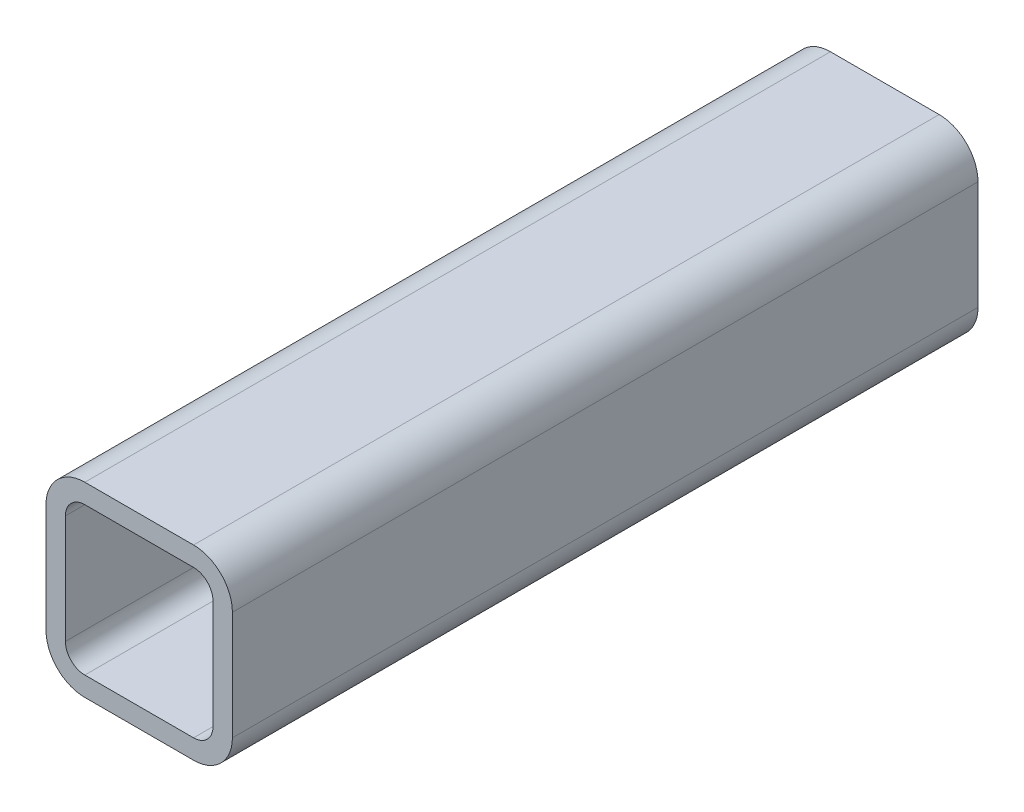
ISO-10303-21;
HEADER;
FILE_DESCRIPTION(('STEP AP214'),'2;1');
FILE_NAME('part.step','',(''),(''),'','','');
FILE_SCHEMA(('AUTOMOTIVE_DESIGN { 1 0 10303 214 1 1 1 1 }'));
ENDSEC;
DATA;
#1=APPLICATION_CONTEXT('core data for automotive mechanical design processes');
#2=APPLICATION_PROTOCOL_DEFINITION('international standard','automotive_design',2000,#1);
#3=PRODUCT_CONTEXT('',#1,'mechanical');
#4=PRODUCT('Part','Part','',(#3));
#5=PRODUCT_RELATED_PRODUCT_CATEGORY('part','',(#4));
#6=PRODUCT_DEFINITION_FORMATION('','',#4);
#7=PRODUCT_DEFINITION_CONTEXT('part definition',#1,'design');
#8=PRODUCT_DEFINITION('design','',#6,#7);
#9=PRODUCT_DEFINITION_SHAPE('','',#8);
#10=(LENGTH_UNIT() NAMED_UNIT(*) SI_UNIT(.MILLI.,.METRE.));
#11=(NAMED_UNIT(*) PLANE_ANGLE_UNIT() SI_UNIT($,.RADIAN.));
#12=(NAMED_UNIT(*) SI_UNIT($,.STERADIAN.) SOLID_ANGLE_UNIT());
#13=UNCERTAINTY_MEASURE_WITH_UNIT(LENGTH_MEASURE(1.E-05),#10,'distance_accuracy_value','');
#14=(GEOMETRIC_REPRESENTATION_CONTEXT(3) GLOBAL_UNCERTAINTY_ASSIGNED_CONTEXT((#13)) GLOBAL_UNIT_ASSIGNED_CONTEXT((#10,
#11,#12)) REPRESENTATION_CONTEXT('',''));
#15=CARTESIAN_POINT('',(0.,0.,0.));
#16=DIRECTION('',(0.,0.,1.));
#17=DIRECTION('',(1.,0.,0.));
#18=AXIS2_PLACEMENT_3D('',#15,#16,#17);
#19=CARTESIAN_POINT('',(18.3641160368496,62.4056737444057,304.8));
#20=DIRECTION('',(0.,0.,1.));
#21=DIRECTION('',(1.,0.,0.));
#22=AXIS2_PLACEMENT_3D('',#19,#20,#21);
#23=PLANE('',#22);
#24=CARTESIAN_POINT('',(18.3641160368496,62.4056737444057,304.8));
#25=DIRECTION('',(0.,0.,1.));
#26=DIRECTION('',(1.,0.,0.));
#27=AXIS2_PLACEMENT_3D('',#24,#25,#26);
#28=CIRCLE('',#27,15.875);
#29=CARTESIAN_POINT('',(18.3641160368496,78.2806737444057,304.8));
#30=VERTEX_POINT('',#29);
#31=CARTESIAN_POINT('',(2.48911603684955,62.4056737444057,304.8));
#32=VERTEX_POINT('',#31);
#33=EDGE_CURVE('E211',#30,#32,#28,.T.);
#34=ORIENTED_EDGE('',*,*,#33,.T.);
#35=DIRECTION('',(0.,-1.,0.));
#36=VECTOR('',#35,1.);
#37=CARTESIAN_POINT('',(2.48911603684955,17.9556737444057,304.8));
#38=LINE('',#37,#36);
#39=CARTESIAN_POINT('',(2.48911603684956,17.9556737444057,304.8));
#40=VERTEX_POINT('',#39);
#41=EDGE_CURVE('E214',#32,#40,#38,.T.);
#42=ORIENTED_EDGE('',*,*,#41,.T.);
#43=CARTESIAN_POINT('',(18.3641160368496,17.9556737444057,304.8));
#44=DIRECTION('',(0.,0.,1.));
#45=DIRECTION('',(1.,0.,0.));
#46=AXIS2_PLACEMENT_3D('',#43,#44,#45);
#47=CIRCLE('',#46,15.875);
#48=CARTESIAN_POINT('',(18.3641160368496,2.0806737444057,304.8));
#49=VERTEX_POINT('',#48);
#50=EDGE_CURVE('E217',#40,#49,#47,.T.);
#51=ORIENTED_EDGE('',*,*,#50,.T.);
#52=DIRECTION('',(1.,0.,0.));
#53=VECTOR('',#52,1.);
#54=CARTESIAN_POINT('',(62.8141160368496,2.0806737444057,304.8));
#55=LINE('',#54,#53);
#56=CARTESIAN_POINT('',(62.8141160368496,2.0806737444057,304.8));
#57=VERTEX_POINT('',#56);
#58=EDGE_CURVE('E219',#49,#57,#55,.T.);
#59=ORIENTED_EDGE('',*,*,#58,.T.);
#60=CARTESIAN_POINT('',(62.8141160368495,17.9556737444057,304.8));
#61=DIRECTION('',(0.,0.,1.));
#62=DIRECTION('',(1.,0.,0.));
#63=AXIS2_PLACEMENT_3D('',#60,#61,#62);
#64=CIRCLE('',#63,15.875);
#65=CARTESIAN_POINT('',(78.6891160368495,17.9556737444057,304.8));
#66=VERTEX_POINT('',#65);
#67=EDGE_CURVE('E221',#57,#66,#64,.T.);
#68=ORIENTED_EDGE('',*,*,#67,.T.);
#69=DIRECTION('',(0.,1.,0.));
#70=VECTOR('',#69,1.);
#71=CARTESIAN_POINT('',(78.6891160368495,62.4056737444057,304.8));
#72=LINE('',#71,#70);
#73=CARTESIAN_POINT('',(78.6891160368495,62.4056737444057,304.8));
#74=VERTEX_POINT('',#73);
#75=EDGE_CURVE('E223',#66,#74,#72,.T.);
#76=ORIENTED_EDGE('',*,*,#75,.T.);
#77=CARTESIAN_POINT('',(62.8141160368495,62.4056737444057,304.8));
#78=DIRECTION('',(0.,0.,1.));
#79=DIRECTION('',(1.,0.,0.));
#80=AXIS2_PLACEMENT_3D('',#77,#78,#79);
#81=CIRCLE('',#80,15.875);
#82=CARTESIAN_POINT('',(62.8141160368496,78.2806737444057,304.8));
#83=VERTEX_POINT('',#82);
#84=EDGE_CURVE('E225',#74,#83,#81,.T.);
#85=ORIENTED_EDGE('',*,*,#84,.T.);
#86=DIRECTION('',(-1.,0.,0.));
#87=VECTOR('',#86,1.);
#88=CARTESIAN_POINT('',(18.3641160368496,78.2806737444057,304.8));
#89=LINE('',#88,#87);
#90=EDGE_CURVE('E227',#83,#30,#89,.T.);
#91=ORIENTED_EDGE('',*,*,#90,.T.);
#92=EDGE_LOOP('',(#34,#42,#51,#59,#68,#76,#85,#91));
#93=FACE_BOUND('',#92,.T.);
#94=DIRECTION('',(0.,-1.,0.));
#95=VECTOR('',#94,1.);
#96=CARTESIAN_POINT('',(10.4266160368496,17.9556737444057,304.8));
#97=LINE('',#96,#95);
#98=CARTESIAN_POINT('',(10.4266160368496,62.4056737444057,304.8));
#99=VERTEX_POINT('',#98);
#100=CARTESIAN_POINT('',(10.4266160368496,17.9556737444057,304.8));
#101=VERTEX_POINT('',#100);
#102=EDGE_CURVE('E154',#99,#101,#97,.T.);
#103=ORIENTED_EDGE('',*,*,#102,.F.);
#104=CARTESIAN_POINT('',(18.3641160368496,62.4056737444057,304.8));
#105=DIRECTION('',(0.,0.,1.));
#106=DIRECTION('',(1.,0.,0.));
#107=AXIS2_PLACEMENT_3D('',#104,#105,#106);
#108=CIRCLE('',#107,7.9375);
#109=CARTESIAN_POINT('',(18.3641160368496,70.3431737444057,304.8));
#110=VERTEX_POINT('',#109);
#111=EDGE_CURVE('E146',#110,#99,#108,.T.);
#112=ORIENTED_EDGE('',*,*,#111,.F.);
#113=DIRECTION('',(-1.,0.,0.));
#114=VECTOR('',#113,1.);
#115=CARTESIAN_POINT('',(18.3641160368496,70.3431737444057,304.8));
#116=LINE('',#115,#114);
#117=CARTESIAN_POINT('',(62.8141160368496,70.3431737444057,304.8));
#118=VERTEX_POINT('',#117);
#119=EDGE_CURVE('E179',#118,#110,#116,.T.);
#120=ORIENTED_EDGE('',*,*,#119,.F.);
#121=CARTESIAN_POINT('',(62.8141160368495,62.4056737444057,304.8));
#122=DIRECTION('',(0.,0.,1.));
#123=DIRECTION('',(1.,0.,0.));
#124=AXIS2_PLACEMENT_3D('',#121,#122,#123);
#125=CIRCLE('',#124,7.9375);
#126=CARTESIAN_POINT('',(70.7516160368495,62.4056737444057,304.8));
#127=VERTEX_POINT('',#126);
#128=EDGE_CURVE('E177',#127,#118,#125,.T.);
#129=ORIENTED_EDGE('',*,*,#128,.F.);
#130=DIRECTION('',(0.,1.,0.));
#131=VECTOR('',#130,1.);
#132=CARTESIAN_POINT('',(70.7516160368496,62.4056737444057,304.8));
#133=LINE('',#132,#131);
#134=CARTESIAN_POINT('',(70.7516160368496,17.9556737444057,304.8));
#135=VERTEX_POINT('',#134);
#136=EDGE_CURVE('E175',#135,#127,#133,.T.);
#137=ORIENTED_EDGE('',*,*,#136,.F.);
#138=CARTESIAN_POINT('',(62.8141160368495,17.9556737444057,304.8));
#139=DIRECTION('',(0.,0.,1.));
#140=DIRECTION('',(1.,0.,0.));
#141=AXIS2_PLACEMENT_3D('',#138,#139,#140);
#142=CIRCLE('',#141,7.93750000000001);
#143=CARTESIAN_POINT('',(62.8141160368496,10.0181737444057,304.8));
#144=VERTEX_POINT('',#143);
#145=EDGE_CURVE('E173',#144,#135,#142,.T.);
#146=ORIENTED_EDGE('',*,*,#145,.F.);
#147=DIRECTION('',(1.,0.,0.));
#148=VECTOR('',#147,1.);
#149=CARTESIAN_POINT('',(62.8141160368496,10.0181737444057,304.8));
#150=LINE('',#149,#148);
#151=CARTESIAN_POINT('',(18.3641160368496,10.0181737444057,304.8));
#152=VERTEX_POINT('',#151);
#153=EDGE_CURVE('E169',#152,#144,#150,.T.);
#154=ORIENTED_EDGE('',*,*,#153,.F.);
#155=CARTESIAN_POINT('',(18.3641160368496,17.9556737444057,304.8));
#156=DIRECTION('',(0.,0.,1.));
#157=DIRECTION('',(1.,0.,0.));
#158=AXIS2_PLACEMENT_3D('',#155,#156,#157);
#159=CIRCLE('',#158,7.9375);
#160=EDGE_CURVE('E167',#101,#152,#159,.T.);
#161=ORIENTED_EDGE('',*,*,#160,.F.);
#162=EDGE_LOOP('',(#103,#112,#120,#129,#137,#146,#154,#161));
#163=FACE_BOUND('',#162,.T.);
#164=ADVANCED_FACE('F33',(#93,#163),#23,.T.);
#165=CARTESIAN_POINT('',(18.3641160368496,62.4056737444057,0.));
#166=DIRECTION('',(0.,0.,1.));
#167=DIRECTION('',(1.,0.,0.));
#168=AXIS2_PLACEMENT_3D('',#165,#166,#167);
#169=PLANE('',#168);
#170=CARTESIAN_POINT('',(18.3641160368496,62.4056737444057,0.));
#171=DIRECTION('',(0.,0.,1.));
#172=DIRECTION('',(1.,0.,0.));
#173=AXIS2_PLACEMENT_3D('',#170,#171,#172);
#174=CIRCLE('',#173,15.875);
#175=CARTESIAN_POINT('',(18.3641160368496,78.2806737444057,0.));
#176=VERTEX_POINT('',#175);
#177=CARTESIAN_POINT('',(2.48911603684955,62.4056737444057,0.));
#178=VERTEX_POINT('',#177);
#179=EDGE_CURVE('E162',#176,#178,#174,.T.);
#180=ORIENTED_EDGE('',*,*,#179,.F.);
#181=DIRECTION('',(-1.,0.,0.));
#182=VECTOR('',#181,1.);
#183=CARTESIAN_POINT('',(18.3641160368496,78.2806737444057,0.));
#184=LINE('',#183,#182);
#185=CARTESIAN_POINT('',(62.8141160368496,78.2806737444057,0.));
#186=VERTEX_POINT('',#185);
#187=EDGE_CURVE('E215',#186,#176,#184,.T.);
#188=ORIENTED_EDGE('',*,*,#187,.F.);
#189=CARTESIAN_POINT('',(62.8141160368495,62.4056737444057,0.));
#190=DIRECTION('',(0.,0.,1.));
#191=DIRECTION('',(1.,0.,0.));
#192=AXIS2_PLACEMENT_3D('',#189,#190,#191);
#193=CIRCLE('',#192,15.875);
#194=CARTESIAN_POINT('',(78.6891160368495,62.4056737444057,0.));
#195=VERTEX_POINT('',#194);
#196=EDGE_CURVE('E242',#195,#186,#193,.T.);
#197=ORIENTED_EDGE('',*,*,#196,.F.);
#198=DIRECTION('',(0.,1.,0.));
#199=VECTOR('',#198,1.);
#200=CARTESIAN_POINT('',(78.6891160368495,62.4056737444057,0.));
#201=LINE('',#200,#199);
#202=CARTESIAN_POINT('',(78.6891160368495,17.9556737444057,0.));
#203=VERTEX_POINT('',#202);
#204=EDGE_CURVE('E240',#203,#195,#201,.T.);
#205=ORIENTED_EDGE('',*,*,#204,.F.);
#206=CARTESIAN_POINT('',(62.8141160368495,17.9556737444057,0.));
#207=DIRECTION('',(0.,0.,1.));
#208=DIRECTION('',(1.,0.,0.));
#209=AXIS2_PLACEMENT_3D('',#206,#207,#208);
#210=CIRCLE('',#209,15.875);
#211=CARTESIAN_POINT('',(62.8141160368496,2.0806737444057,0.));
#212=VERTEX_POINT('',#211);
#213=EDGE_CURVE('E238',#212,#203,#210,.T.);
#214=ORIENTED_EDGE('',*,*,#213,.F.);
#215=DIRECTION('',(1.,0.,0.));
#216=VECTOR('',#215,1.);
#217=CARTESIAN_POINT('',(62.8141160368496,2.0806737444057,0.));
#218=LINE('',#217,#216);
#219=CARTESIAN_POINT('',(18.3641160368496,2.0806737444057,0.));
#220=VERTEX_POINT('',#219);
#221=EDGE_CURVE('E236',#220,#212,#218,.T.);
#222=ORIENTED_EDGE('',*,*,#221,.F.);
#223=CARTESIAN_POINT('',(18.3641160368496,17.9556737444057,0.));
#224=DIRECTION('',(0.,0.,1.));
#225=DIRECTION('',(1.,0.,0.));
#226=AXIS2_PLACEMENT_3D('',#223,#224,#225);
#227=CIRCLE('',#226,15.875);
#228=CARTESIAN_POINT('',(2.48911603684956,17.9556737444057,0.));
#229=VERTEX_POINT('',#228);
#230=EDGE_CURVE('E234',#229,#220,#227,.T.);
#231=ORIENTED_EDGE('',*,*,#230,.F.);
#232=DIRECTION('',(0.,-1.,0.));
#233=VECTOR('',#232,1.);
#234=CARTESIAN_POINT('',(2.48911603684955,17.9556737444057,0.));
#235=LINE('',#234,#233);
#236=EDGE_CURVE('E232',#178,#229,#235,.T.);
#237=ORIENTED_EDGE('',*,*,#236,.F.);
#238=EDGE_LOOP('',(#180,#188,#197,#205,#214,#222,#231,#237));
#239=FACE_BOUND('',#238,.T.);
#240=CARTESIAN_POINT('',(18.3641160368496,62.4056737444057,0.));
#241=DIRECTION('',(0.,0.,1.));
#242=DIRECTION('',(1.,0.,0.));
#243=AXIS2_PLACEMENT_3D('',#240,#241,#242);
#244=CIRCLE('',#243,7.9375);
#245=CARTESIAN_POINT('',(18.3641160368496,70.3431737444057,0.));
#246=VERTEX_POINT('',#245);
#247=CARTESIAN_POINT('',(10.4266160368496,62.4056737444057,0.));
#248=VERTEX_POINT('',#247);
#249=EDGE_CURVE('E56',#246,#248,#244,.T.);
#250=ORIENTED_EDGE('',*,*,#249,.T.);
#251=DIRECTION('',(0.,-1.,0.));
#252=VECTOR('',#251,1.);
#253=CARTESIAN_POINT('',(10.4266160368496,17.9556737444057,0.));
#254=LINE('',#253,#252);
#255=CARTESIAN_POINT('',(10.4266160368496,17.9556737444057,0.));
#256=VERTEX_POINT('',#255);
#257=EDGE_CURVE('E161',#248,#256,#254,.T.);
#258=ORIENTED_EDGE('',*,*,#257,.T.);
#259=CARTESIAN_POINT('',(18.3641160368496,17.9556737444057,0.));
#260=DIRECTION('',(0.,0.,1.));
#261=DIRECTION('',(1.,0.,0.));
#262=AXIS2_PLACEMENT_3D('',#259,#260,#261);
#263=CIRCLE('',#262,7.9375);
#264=CARTESIAN_POINT('',(18.3641160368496,10.0181737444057,0.));
#265=VERTEX_POINT('',#264);
#266=EDGE_CURVE('E183',#256,#265,#263,.T.);
#267=ORIENTED_EDGE('',*,*,#266,.T.);
#268=DIRECTION('',(1.,0.,0.));
#269=VECTOR('',#268,1.);
#270=CARTESIAN_POINT('',(62.8141160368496,10.0181737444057,0.));
#271=LINE('',#270,#269);
#272=CARTESIAN_POINT('',(62.8141160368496,10.0181737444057,0.));
#273=VERTEX_POINT('',#272);
#274=EDGE_CURVE('E186',#265,#273,#271,.T.);
#275=ORIENTED_EDGE('',*,*,#274,.T.);
#276=CARTESIAN_POINT('',(62.8141160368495,17.9556737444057,0.));
#277=DIRECTION('',(0.,0.,1.));
#278=DIRECTION('',(1.,0.,0.));
#279=AXIS2_PLACEMENT_3D('',#276,#277,#278);
#280=CIRCLE('',#279,7.93750000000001);
#281=CARTESIAN_POINT('',(70.7516160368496,17.9556737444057,0.));
#282=VERTEX_POINT('',#281);
#283=EDGE_CURVE('E189',#273,#282,#280,.T.);
#284=ORIENTED_EDGE('',*,*,#283,.T.);
#285=DIRECTION('',(0.,1.,0.));
#286=VECTOR('',#285,1.);
#287=CARTESIAN_POINT('',(70.7516160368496,62.4056737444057,0.));
#288=LINE('',#287,#286);
#289=CARTESIAN_POINT('',(70.7516160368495,62.4056737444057,0.));
#290=VERTEX_POINT('',#289);
#291=EDGE_CURVE('E192',#282,#290,#288,.T.);
#292=ORIENTED_EDGE('',*,*,#291,.T.);
#293=CARTESIAN_POINT('',(62.8141160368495,62.4056737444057,0.));
#294=DIRECTION('',(0.,0.,1.));
#295=DIRECTION('',(1.,0.,0.));
#296=AXIS2_PLACEMENT_3D('',#293,#294,#295);
#297=CIRCLE('',#296,7.9375);
#298=CARTESIAN_POINT('',(62.8141160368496,70.3431737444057,0.));
#299=VERTEX_POINT('',#298);
#300=EDGE_CURVE('E195',#290,#299,#297,.T.);
#301=ORIENTED_EDGE('',*,*,#300,.T.);
#302=DIRECTION('',(-1.,0.,0.));
#303=VECTOR('',#302,1.);
#304=CARTESIAN_POINT('',(18.3641160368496,70.3431737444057,0.));
#305=LINE('',#304,#303);
#306=EDGE_CURVE('E155',#299,#246,#305,.T.);
#307=ORIENTED_EDGE('',*,*,#306,.T.);
#308=EDGE_LOOP('',(#250,#258,#267,#275,#284,#292,#301,#307));
#309=FACE_BOUND('',#308,.T.);
#310=ADVANCED_FACE('F272',(#239,#309),#169,.F.);
#311=CARTESIAN_POINT('',(18.3641160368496,62.4056737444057,304.8));
#312=DIRECTION('',(0.,0.,-1.));
#313=DIRECTION('',(-1.,0.,0.));
#314=AXIS2_PLACEMENT_3D('',#311,#312,#313);
#315=CYLINDRICAL_SURFACE('',#314,15.875);
#316=ORIENTED_EDGE('',*,*,#179,.T.);
#317=DIRECTION('',(0.,0.,-1.));
#318=VECTOR('',#317,1.);
#319=CARTESIAN_POINT('',(2.48911603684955,62.4056737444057,304.8));
#320=LINE('',#319,#318);
#321=EDGE_CURVE('E11',#32,#178,#320,.T.);
#322=ORIENTED_EDGE('',*,*,#321,.F.);
#323=ORIENTED_EDGE('',*,*,#33,.F.);
#324=DIRECTION('',(0.,0.,-1.));
#325=VECTOR('',#324,1.);
#326=CARTESIAN_POINT('',(18.3641160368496,78.2806737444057,304.8));
#327=LINE('',#326,#325);
#328=EDGE_CURVE('E229',#30,#176,#327,.T.);
#329=ORIENTED_EDGE('',*,*,#328,.T.);
#330=EDGE_LOOP('',(#316,#322,#323,#329));
#331=FACE_BOUND('',#330,.T.);
#332=ADVANCED_FACE('F35',(#331),#315,.T.);
#333=CARTESIAN_POINT('',(2.48911603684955,17.9556737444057,304.8));
#334=DIRECTION('',(1.,0.,0.));
#335=DIRECTION('',(0.,0.,-1.));
#336=AXIS2_PLACEMENT_3D('',#333,#334,#335);
#337=PLANE('',#336);
#338=ORIENTED_EDGE('',*,*,#236,.T.);
#339=DIRECTION('',(0.,0.,-1.));
#340=VECTOR('',#339,1.);
#341=CARTESIAN_POINT('',(2.48911603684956,17.9556737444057,304.8));
#342=LINE('',#341,#340);
#343=EDGE_CURVE('E41',#40,#229,#342,.T.);
#344=ORIENTED_EDGE('',*,*,#343,.F.);
#345=ORIENTED_EDGE('',*,*,#41,.F.);
#346=ORIENTED_EDGE('',*,*,#321,.T.);
#347=EDGE_LOOP('',(#338,#344,#345,#346));
#348=FACE_BOUND('',#347,.T.);
#349=ADVANCED_FACE('F289',(#348),#337,.F.);
#350=CARTESIAN_POINT('',(18.3641160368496,17.9556737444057,304.8));
#351=DIRECTION('',(0.,0.,-1.));
#352=DIRECTION('',(-1.,0.,0.));
#353=AXIS2_PLACEMENT_3D('',#350,#351,#352);
#354=CYLINDRICAL_SURFACE('',#353,15.875);
#355=ORIENTED_EDGE('',*,*,#230,.T.);
#356=DIRECTION('',(0.,0.,-1.));
#357=VECTOR('',#356,1.);
#358=CARTESIAN_POINT('',(18.3641160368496,2.0806737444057,304.8));
#359=LINE('',#358,#357);
#360=EDGE_CURVE('E259',#49,#220,#359,.T.);
#361=ORIENTED_EDGE('',*,*,#360,.F.);
#362=ORIENTED_EDGE('',*,*,#50,.F.);
#363=ORIENTED_EDGE('',*,*,#343,.T.);
#364=EDGE_LOOP('',(#355,#361,#362,#363));
#365=FACE_BOUND('',#364,.T.);
#366=ADVANCED_FACE('F266',(#365),#354,.T.);
#367=CARTESIAN_POINT('',(62.8141160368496,2.0806737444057,304.8));
#368=DIRECTION('',(0.,1.,0.));
#369=DIRECTION('',(0.,0.,1.));
#370=AXIS2_PLACEMENT_3D('',#367,#368,#369);
#371=PLANE('',#370);
#372=ORIENTED_EDGE('',*,*,#221,.T.);
#373=DIRECTION('',(0.,0.,-1.));
#374=VECTOR('',#373,1.);
#375=CARTESIAN_POINT('',(62.8141160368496,2.0806737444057,304.8));
#376=LINE('',#375,#374);
#377=EDGE_CURVE('E256',#57,#212,#376,.T.);
#378=ORIENTED_EDGE('',*,*,#377,.F.);
#379=ORIENTED_EDGE('',*,*,#58,.F.);
#380=ORIENTED_EDGE('',*,*,#360,.T.);
#381=EDGE_LOOP('',(#372,#378,#379,#380));
#382=FACE_BOUND('',#381,.T.);
#383=ADVANCED_FACE('F278',(#382),#371,.F.);
#384=CARTESIAN_POINT('',(62.8141160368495,17.9556737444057,304.8));
#385=DIRECTION('',(0.,0.,-1.));
#386=DIRECTION('',(-1.,0.,0.));
#387=AXIS2_PLACEMENT_3D('',#384,#385,#386);
#388=CYLINDRICAL_SURFACE('',#387,15.875);
#389=ORIENTED_EDGE('',*,*,#213,.T.);
#390=DIRECTION('',(0.,0.,-1.));
#391=VECTOR('',#390,1.);
#392=CARTESIAN_POINT('',(78.6891160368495,17.9556737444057,304.8));
#393=LINE('',#392,#391);
#394=EDGE_CURVE('E253',#66,#203,#393,.T.);
#395=ORIENTED_EDGE('',*,*,#394,.F.);
#396=ORIENTED_EDGE('',*,*,#67,.F.);
#397=ORIENTED_EDGE('',*,*,#377,.T.);
#398=EDGE_LOOP('',(#389,#395,#396,#397));
#399=FACE_BOUND('',#398,.T.);
#400=ADVANCED_FACE('F282',(#399),#388,.T.);
#401=CARTESIAN_POINT('',(78.6891160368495,62.4056737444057,304.8));
#402=DIRECTION('',(-1.,0.,0.));
#403=DIRECTION('',(0.,0.,1.));
#404=AXIS2_PLACEMENT_3D('',#401,#402,#403);
#405=PLANE('',#404);
#406=ORIENTED_EDGE('',*,*,#204,.T.);
#407=DIRECTION('',(0.,0.,-1.));
#408=VECTOR('',#407,1.);
#409=CARTESIAN_POINT('',(78.6891160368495,62.4056737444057,304.8));
#410=LINE('',#409,#408);
#411=EDGE_CURVE('E250',#74,#195,#410,.T.);
#412=ORIENTED_EDGE('',*,*,#411,.F.);
#413=ORIENTED_EDGE('',*,*,#75,.F.);
#414=ORIENTED_EDGE('',*,*,#394,.T.);
#415=EDGE_LOOP('',(#406,#412,#413,#414));
#416=FACE_BOUND('',#415,.T.);
#417=ADVANCED_FACE('F302',(#416),#405,.F.);
#418=CARTESIAN_POINT('',(62.8141160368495,62.4056737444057,304.8));
#419=DIRECTION('',(0.,0.,-1.));
#420=DIRECTION('',(-1.,0.,0.));
#421=AXIS2_PLACEMENT_3D('',#418,#419,#420);
#422=CYLINDRICAL_SURFACE('',#421,15.875);
#423=ORIENTED_EDGE('',*,*,#196,.T.);
#424=DIRECTION('',(0.,0.,-1.));
#425=VECTOR('',#424,1.);
#426=CARTESIAN_POINT('',(62.8141160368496,78.2806737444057,304.8));
#427=LINE('',#426,#425);
#428=EDGE_CURVE('E247',#83,#186,#427,.T.);
#429=ORIENTED_EDGE('',*,*,#428,.F.);
#430=ORIENTED_EDGE('',*,*,#84,.F.);
#431=ORIENTED_EDGE('',*,*,#411,.T.);
#432=EDGE_LOOP('',(#423,#429,#430,#431));
#433=FACE_BOUND('',#432,.T.);
#434=ADVANCED_FACE('F300',(#433),#422,.T.);
#435=CARTESIAN_POINT('',(18.3641160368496,78.2806737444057,304.8));
#436=DIRECTION('',(0.,-1.,0.));
#437=DIRECTION('',(0.,0.,-1.));
#438=AXIS2_PLACEMENT_3D('',#435,#436,#437);
#439=PLANE('',#438);
#440=ORIENTED_EDGE('',*,*,#187,.T.);
#441=ORIENTED_EDGE('',*,*,#328,.F.);
#442=ORIENTED_EDGE('',*,*,#90,.F.);
#443=ORIENTED_EDGE('',*,*,#428,.T.);
#444=EDGE_LOOP('',(#440,#441,#442,#443));
#445=FACE_BOUND('',#444,.T.);
#446=ADVANCED_FACE('F295',(#445),#439,.F.);
#447=CARTESIAN_POINT('',(18.3641160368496,62.4056737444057,304.8));
#448=DIRECTION('',(0.,0.,-1.));
#449=DIRECTION('',(-1.,0.,0.));
#450=AXIS2_PLACEMENT_3D('',#447,#448,#449);
#451=CYLINDRICAL_SURFACE('',#450,7.9375);
#452=ORIENTED_EDGE('',*,*,#249,.F.);
#453=DIRECTION('',(0.,0.,-1.));
#454=VECTOR('',#453,1.);
#455=CARTESIAN_POINT('',(18.3641160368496,70.3431737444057,304.8));
#456=LINE('',#455,#454);
#457=EDGE_CURVE('E150',#110,#246,#456,.T.);
#458=ORIENTED_EDGE('',*,*,#457,.F.);
#459=ORIENTED_EDGE('',*,*,#111,.T.);
#460=DIRECTION('',(0.,0.,-1.));
#461=VECTOR('',#460,1.);
#462=CARTESIAN_POINT('',(10.4266160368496,62.4056737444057,304.8));
#463=LINE('',#462,#461);
#464=EDGE_CURVE('E149',#99,#248,#463,.T.);
#465=ORIENTED_EDGE('',*,*,#464,.T.);
#466=EDGE_LOOP('',(#452,#458,#459,#465));
#467=FACE_BOUND('',#466,.T.);
#468=ADVANCED_FACE('F148',(#467),#451,.F.);
#469=CARTESIAN_POINT('',(10.4266160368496,17.9556737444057,304.8));
#470=DIRECTION('',(1.,0.,0.));
#471=DIRECTION('',(0.,0.,-1.));
#472=AXIS2_PLACEMENT_3D('',#469,#470,#471);
#473=PLANE('',#472);
#474=ORIENTED_EDGE('',*,*,#257,.F.);
#475=ORIENTED_EDGE('',*,*,#464,.F.);
#476=ORIENTED_EDGE('',*,*,#102,.T.);
#477=DIRECTION('',(0.,0.,-1.));
#478=VECTOR('',#477,1.);
#479=CARTESIAN_POINT('',(10.4266160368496,17.9556737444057,304.8));
#480=LINE('',#479,#478);
#481=EDGE_CURVE('E163',#101,#256,#480,.T.);
#482=ORIENTED_EDGE('',*,*,#481,.T.);
#483=EDGE_LOOP('',(#474,#475,#476,#482));
#484=FACE_BOUND('',#483,.T.);
#485=ADVANCED_FACE('F158',(#484),#473,.T.);
#486=CARTESIAN_POINT('',(18.3641160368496,17.9556737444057,304.8));
#487=DIRECTION('',(0.,0.,-1.));
#488=DIRECTION('',(-1.,0.,0.));
#489=AXIS2_PLACEMENT_3D('',#486,#487,#488);
#490=CYLINDRICAL_SURFACE('',#489,7.9375);
#491=ORIENTED_EDGE('',*,*,#266,.F.);
#492=ORIENTED_EDGE('',*,*,#481,.F.);
#493=ORIENTED_EDGE('',*,*,#160,.T.);
#494=DIRECTION('',(0.,0.,-1.));
#495=VECTOR('',#494,1.);
#496=CARTESIAN_POINT('',(18.3641160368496,10.0181737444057,304.8));
#497=LINE('',#496,#495);
#498=EDGE_CURVE('E208',#152,#265,#497,.T.);
#499=ORIENTED_EDGE('',*,*,#498,.T.);
#500=EDGE_LOOP('',(#491,#492,#493,#499));
#501=FACE_BOUND('',#500,.T.);
#502=ADVANCED_FACE('F327',(#501),#490,.F.);
#503=CARTESIAN_POINT('',(62.8141160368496,10.0181737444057,304.8));
#504=DIRECTION('',(0.,1.,0.));
#505=DIRECTION('',(0.,0.,1.));
#506=AXIS2_PLACEMENT_3D('',#503,#504,#505);
#507=PLANE('',#506);
#508=ORIENTED_EDGE('',*,*,#274,.F.);
#509=ORIENTED_EDGE('',*,*,#498,.F.);
#510=ORIENTED_EDGE('',*,*,#153,.T.);
#511=DIRECTION('',(0.,0.,-1.));
#512=VECTOR('',#511,1.);
#513=CARTESIAN_POINT('',(62.8141160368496,10.0181737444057,304.8));
#514=LINE('',#513,#512);
#515=EDGE_CURVE('E206',#144,#273,#514,.T.);
#516=ORIENTED_EDGE('',*,*,#515,.T.);
#517=EDGE_LOOP('',(#508,#509,#510,#516));
#518=FACE_BOUND('',#517,.T.);
#519=ADVANCED_FACE('F331',(#518),#507,.T.);
#520=CARTESIAN_POINT('',(62.8141160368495,17.9556737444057,304.8));
#521=DIRECTION('',(0.,0.,-1.));
#522=DIRECTION('',(-1.,0.,0.));
#523=AXIS2_PLACEMENT_3D('',#520,#521,#522);
#524=CYLINDRICAL_SURFACE('',#523,7.93750000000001);
#525=ORIENTED_EDGE('',*,*,#283,.F.);
#526=ORIENTED_EDGE('',*,*,#515,.F.);
#527=ORIENTED_EDGE('',*,*,#145,.T.);
#528=DIRECTION('',(0.,0.,-1.));
#529=VECTOR('',#528,1.);
#530=CARTESIAN_POINT('',(70.7516160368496,17.9556737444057,304.8));
#531=LINE('',#530,#529);
#532=EDGE_CURVE('E204',#135,#282,#531,.T.);
#533=ORIENTED_EDGE('',*,*,#532,.T.);
#534=EDGE_LOOP('',(#525,#526,#527,#533));
#535=FACE_BOUND('',#534,.T.);
#536=ADVANCED_FACE('F337',(#535),#524,.F.);
#537=CARTESIAN_POINT('',(70.7516160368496,62.4056737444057,304.8));
#538=DIRECTION('',(-1.,0.,0.));
#539=DIRECTION('',(0.,0.,1.));
#540=AXIS2_PLACEMENT_3D('',#537,#538,#539);
#541=PLANE('',#540);
#542=ORIENTED_EDGE('',*,*,#291,.F.);
#543=ORIENTED_EDGE('',*,*,#532,.F.);
#544=ORIENTED_EDGE('',*,*,#136,.T.);
#545=DIRECTION('',(0.,0.,-1.));
#546=VECTOR('',#545,1.);
#547=CARTESIAN_POINT('',(70.7516160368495,62.4056737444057,304.8));
#548=LINE('',#547,#546);
#549=EDGE_CURVE('E202',#127,#290,#548,.T.);
#550=ORIENTED_EDGE('',*,*,#549,.T.);
#551=EDGE_LOOP('',(#542,#543,#544,#550));
#552=FACE_BOUND('',#551,.T.);
#553=ADVANCED_FACE('F341',(#552),#541,.T.);
#554=CARTESIAN_POINT('',(62.8141160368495,62.4056737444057,304.8));
#555=DIRECTION('',(0.,0.,-1.));
#556=DIRECTION('',(-1.,0.,0.));
#557=AXIS2_PLACEMENT_3D('',#554,#555,#556);
#558=CYLINDRICAL_SURFACE('',#557,7.9375);
#559=ORIENTED_EDGE('',*,*,#300,.F.);
#560=ORIENTED_EDGE('',*,*,#549,.F.);
#561=ORIENTED_EDGE('',*,*,#128,.T.);
#562=DIRECTION('',(0.,0.,-1.));
#563=VECTOR('',#562,1.);
#564=CARTESIAN_POINT('',(62.8141160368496,70.3431737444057,304.8));
#565=LINE('',#564,#563);
#566=EDGE_CURVE('E48',#118,#299,#565,.T.);
#567=ORIENTED_EDGE('',*,*,#566,.T.);
#568=EDGE_LOOP('',(#559,#560,#561,#567));
#569=FACE_BOUND('',#568,.T.);
#570=ADVANCED_FACE('F345',(#569),#558,.F.);
#571=CARTESIAN_POINT('',(18.3641160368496,70.3431737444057,304.8));
#572=DIRECTION('',(0.,-1.,0.));
#573=DIRECTION('',(0.,0.,-1.));
#574=AXIS2_PLACEMENT_3D('',#571,#572,#573);
#575=PLANE('',#574);
#576=ORIENTED_EDGE('',*,*,#306,.F.);
#577=ORIENTED_EDGE('',*,*,#566,.F.);
#578=ORIENTED_EDGE('',*,*,#119,.T.);
#579=ORIENTED_EDGE('',*,*,#457,.T.);
#580=EDGE_LOOP('',(#576,#577,#578,#579));
#581=FACE_BOUND('',#580,.T.);
#582=ADVANCED_FACE('F349',(#581),#575,.T.);
#583=CLOSED_SHELL('',(#164,#310,#332,#349,#366,#383,#400,#417,#434,#446,#468,#485,#502,#519,
#536,#553,#570,#582));
#584=MANIFOLD_SOLID_BREP('B2',#583);
#585=ADVANCED_BREP_SHAPE_REPRESENTATION('',(#18,#584),#14);
#586=SHAPE_DEFINITION_REPRESENTATION(#9,#585);
ENDSEC;
END-ISO-10303-21;
